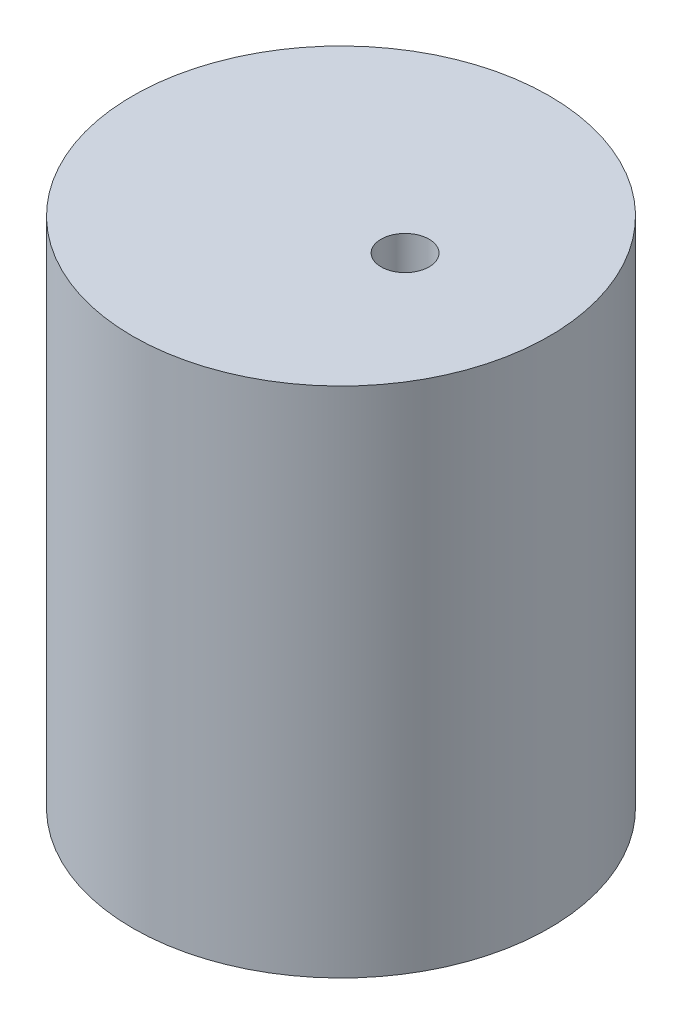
ISO-10303-21;
HEADER;
FILE_DESCRIPTION(('STEP AP214'),'2;1');
FILE_NAME('part.step','',(''),(''),'','','');
FILE_SCHEMA(('AUTOMOTIVE_DESIGN { 1 0 10303 214 1 1 1 1 }'));
ENDSEC;
DATA;
#1=APPLICATION_CONTEXT('core data for automotive mechanical design processes');
#2=APPLICATION_PROTOCOL_DEFINITION('international standard','automotive_design',2000,#1);
#3=PRODUCT_CONTEXT('',#1,'mechanical');
#4=PRODUCT('Part','Part','',(#3));
#5=PRODUCT_RELATED_PRODUCT_CATEGORY('part','',(#4));
#6=PRODUCT_DEFINITION_FORMATION('','',#4);
#7=PRODUCT_DEFINITION_CONTEXT('part definition',#1,'design');
#8=PRODUCT_DEFINITION('design','',#6,#7);
#9=PRODUCT_DEFINITION_SHAPE('','',#8);
#10=(LENGTH_UNIT() NAMED_UNIT(*) SI_UNIT(.MILLI.,.METRE.));
#11=(NAMED_UNIT(*) PLANE_ANGLE_UNIT() SI_UNIT($,.RADIAN.));
#12=(NAMED_UNIT(*) SI_UNIT($,.STERADIAN.) SOLID_ANGLE_UNIT());
#13=UNCERTAINTY_MEASURE_WITH_UNIT(LENGTH_MEASURE(1.E-05),#10,'distance_accuracy_value','');
#14=(GEOMETRIC_REPRESENTATION_CONTEXT(3) GLOBAL_UNCERTAINTY_ASSIGNED_CONTEXT((#13)) GLOBAL_UNIT_ASSIGNED_CONTEXT((#10,
#11,#12)) REPRESENTATION_CONTEXT('',''));
#15=CARTESIAN_POINT('',(0.,0.,0.));
#16=DIRECTION('',(0.,0.,1.));
#17=DIRECTION('',(1.,0.,0.));
#18=AXIS2_PLACEMENT_3D('',#15,#16,#17);
#19=CARTESIAN_POINT('',(0.,32.,0.));
#20=DIRECTION('',(0.,1.,0.));
#21=DIRECTION('',(0.,0.,1.));
#22=AXIS2_PLACEMENT_3D('',#19,#20,#21);
#23=PLANE('',#22);
#24=CARTESIAN_POINT('',(0.,32.,0.));
#25=DIRECTION('',(0.,1.,0.));
#26=DIRECTION('',(0.,0.,1.));
#27=AXIS2_PLACEMENT_3D('',#24,#25,#26);
#28=CIRCLE('',#27,13.);
#29=CARTESIAN_POINT('',(0.,32.,13.));
#30=VERTEX_POINT('',#29);
#31=EDGE_CURVE('E9',#30,#30,#28,.T.);
#32=ORIENTED_EDGE('',*,*,#31,.T.);
#33=EDGE_LOOP('',(#32));
#34=FACE_BOUND('',#33,.T.);
#35=CARTESIAN_POINT('',(4.,32.,0.));
#36=DIRECTION('',(0.,1.,0.));
#37=DIRECTION('',(0.,0.,1.));
#38=AXIS2_PLACEMENT_3D('',#35,#36,#37);
#39=CIRCLE('',#38,1.5);
#40=CARTESIAN_POINT('',(4.,32.,1.5));
#41=VERTEX_POINT('',#40);
#42=EDGE_CURVE('E25',#41,#41,#39,.T.);
#43=ORIENTED_EDGE('',*,*,#42,.F.);
#44=EDGE_LOOP('',(#43));
#45=FACE_BOUND('',#44,.T.);
#46=ADVANCED_FACE('F14',(#34,#45),#23,.T.);
#47=CARTESIAN_POINT('',(0.,0.,0.));
#48=DIRECTION('',(0.,1.,0.));
#49=DIRECTION('',(0.,0.,1.));
#50=AXIS2_PLACEMENT_3D('',#47,#48,#49);
#51=PLANE('',#50);
#52=CARTESIAN_POINT('',(0.,0.,0.));
#53=DIRECTION('',(0.,1.,0.));
#54=DIRECTION('',(0.,0.,1.));
#55=AXIS2_PLACEMENT_3D('',#52,#53,#54);
#56=CIRCLE('',#55,13.);
#57=CARTESIAN_POINT('',(0.,0.,13.));
#58=VERTEX_POINT('',#57);
#59=EDGE_CURVE('E18',#58,#58,#56,.T.);
#60=ORIENTED_EDGE('',*,*,#59,.F.);
#61=EDGE_LOOP('',(#60));
#62=FACE_BOUND('',#61,.T.);
#63=CARTESIAN_POINT('',(4.,0.,0.));
#64=DIRECTION('',(0.,1.,0.));
#65=DIRECTION('',(0.,0.,1.));
#66=AXIS2_PLACEMENT_3D('',#63,#64,#65);
#67=CIRCLE('',#66,1.5);
#68=CARTESIAN_POINT('',(4.,0.,1.5));
#69=VERTEX_POINT('',#68);
#70=EDGE_CURVE('E27',#69,#69,#67,.T.);
#71=ORIENTED_EDGE('',*,*,#70,.T.);
#72=EDGE_LOOP('',(#71));
#73=FACE_BOUND('',#72,.T.);
#74=ADVANCED_FACE('F37',(#62,#73),#51,.F.);
#75=CARTESIAN_POINT('',(0.,32.,0.));
#76=DIRECTION('',(0.,-1.,0.));
#77=DIRECTION('',(0.,0.,-1.));
#78=AXIS2_PLACEMENT_3D('',#75,#76,#77);
#79=CYLINDRICAL_SURFACE('',#78,13.);
#80=ORIENTED_EDGE('',*,*,#31,.F.);
#81=EDGE_LOOP('',(#80));
#82=FACE_BOUND('',#81,.T.);
#83=ORIENTED_EDGE('',*,*,#59,.T.);
#84=EDGE_LOOP('',(#83));
#85=FACE_BOUND('',#84,.T.);
#86=ADVANCED_FACE('F16',(#82,#85),#79,.T.);
#87=CARTESIAN_POINT('',(4.,32.,0.));
#88=DIRECTION('',(0.,-1.,0.));
#89=DIRECTION('',(0.,0.,-1.));
#90=AXIS2_PLACEMENT_3D('',#87,#88,#89);
#91=CYLINDRICAL_SURFACE('',#90,1.5);
#92=ORIENTED_EDGE('',*,*,#42,.T.);
#93=EDGE_LOOP('',(#92));
#94=FACE_BOUND('',#93,.T.);
#95=ORIENTED_EDGE('',*,*,#70,.F.);
#96=EDGE_LOOP('',(#95));
#97=FACE_BOUND('',#96,.T.);
#98=ADVANCED_FACE('F33',(#94,#97),#91,.F.);
#99=CLOSED_SHELL('',(#46,#74,#86,#98));
#100=MANIFOLD_SOLID_BREP('B1',#99);
#101=ADVANCED_BREP_SHAPE_REPRESENTATION('',(#18,#100),#14);
#102=SHAPE_DEFINITION_REPRESENTATION(#9,#101);
ENDSEC;
END-ISO-10303-21;
